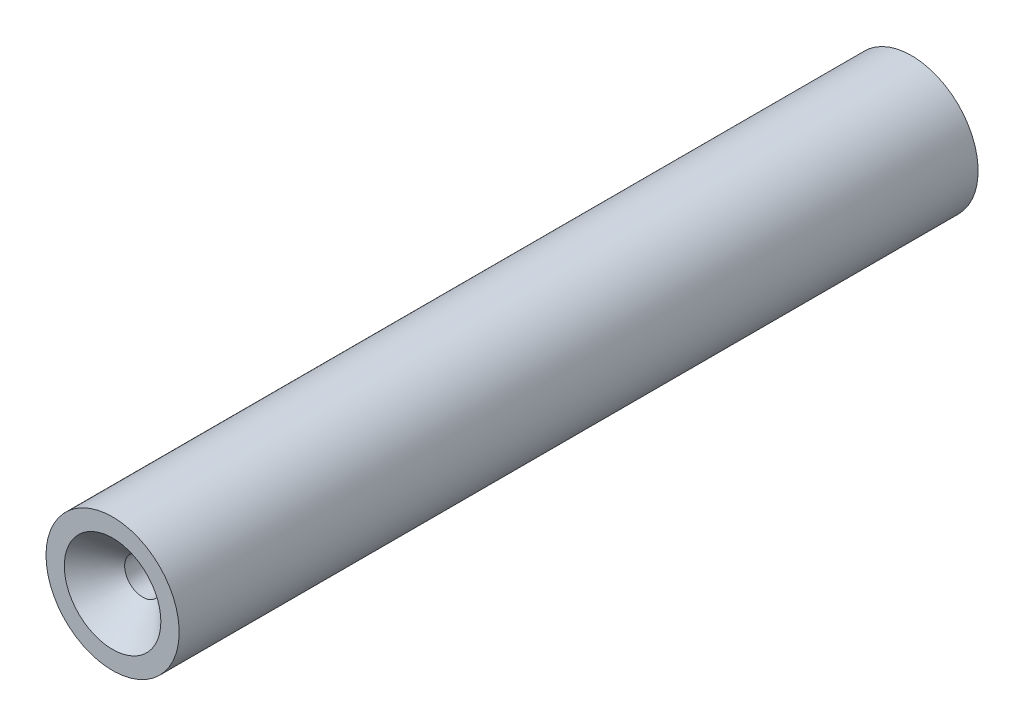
ISO-10303-21;
HEADER;
FILE_DESCRIPTION(('STEP AP214'),'2;1');
FILE_NAME('part.step','',(''),(''),'','','');
FILE_SCHEMA(('AUTOMOTIVE_DESIGN { 1 0 10303 214 1 1 1 1 }'));
ENDSEC;
DATA;
#1=APPLICATION_CONTEXT('core data for automotive mechanical design processes');
#2=APPLICATION_PROTOCOL_DEFINITION('international standard','automotive_design',2000,#1);
#3=PRODUCT_CONTEXT('',#1,'mechanical');
#4=PRODUCT('Part','Part','',(#3));
#5=PRODUCT_RELATED_PRODUCT_CATEGORY('part','',(#4));
#6=PRODUCT_DEFINITION_FORMATION('','',#4);
#7=PRODUCT_DEFINITION_CONTEXT('part definition',#1,'design');
#8=PRODUCT_DEFINITION('design','',#6,#7);
#9=PRODUCT_DEFINITION_SHAPE('','',#8);
#10=(LENGTH_UNIT() NAMED_UNIT(*) SI_UNIT(.MILLI.,.METRE.));
#11=(NAMED_UNIT(*) PLANE_ANGLE_UNIT() SI_UNIT($,.RADIAN.));
#12=(NAMED_UNIT(*) SI_UNIT($,.STERADIAN.) SOLID_ANGLE_UNIT());
#13=UNCERTAINTY_MEASURE_WITH_UNIT(LENGTH_MEASURE(1.E-05),#10,'distance_accuracy_value','');
#14=(GEOMETRIC_REPRESENTATION_CONTEXT(3) GLOBAL_UNCERTAINTY_ASSIGNED_CONTEXT((#13)) GLOBAL_UNIT_ASSIGNED_CONTEXT((#10,
#11,#12)) REPRESENTATION_CONTEXT('',''));
#15=CARTESIAN_POINT('',(0.,0.,0.));
#16=DIRECTION('',(0.,0.,1.));
#17=DIRECTION('',(1.,0.,0.));
#18=AXIS2_PLACEMENT_3D('',#15,#16,#17);
#19=CARTESIAN_POINT('',(-114.66320988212,59.9894740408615,76.2));
#20=DIRECTION('',(0.,0.,-1.));
#21=DIRECTION('',(-1.,0.,0.));
#22=AXIS2_PLACEMENT_3D('',#19,#20,#21);
#23=CYLINDRICAL_SURFACE('',#22,6.35);
#24=CARTESIAN_POINT('',(-114.66320988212,59.9894740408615,76.2));
#25=DIRECTION('',(0.,0.,1.));
#26=DIRECTION('',(1.,0.,0.));
#27=AXIS2_PLACEMENT_3D('',#24,#25,#26);
#28=CIRCLE('',#27,6.35);
#29=CARTESIAN_POINT('',(-121.01320988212,59.9894740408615,76.2));
#30=VERTEX_POINT('',#29);
#31=EDGE_CURVE('E11',#30,#30,#28,.T.);
#32=CARTESIAN_POINT('',(-114.66320988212,59.9894740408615,0.));
#33=DIRECTION('',(0.,0.,1.));
#34=DIRECTION('',(1.,0.,0.));
#35=AXIS2_PLACEMENT_3D('',#32,#33,#34);
#36=CIRCLE('',#35,6.35);
#37=CARTESIAN_POINT('',(-121.01320988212,59.9894740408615,0.));
#38=VERTEX_POINT('',#37);
#39=EDGE_CURVE('E43',#38,#38,#36,.T.);
#40=CARTESIAN_POINT('',(-121.01320988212,59.9894740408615,76.2));
#41=CARTESIAN_POINT('',(-121.01320988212,59.9894740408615,75.40625));
#42=CARTESIAN_POINT('',(-121.01320988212,59.9894740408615,74.6125));
#43=CARTESIAN_POINT('',(-121.01320988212,59.9894740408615,73.025));
#44=CARTESIAN_POINT('',(-121.01320988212,59.9894740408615,72.23125));
#45=CARTESIAN_POINT('',(-121.01320988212,59.9894740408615,70.64375));
#46=CARTESIAN_POINT('',(-121.01320988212,59.9894740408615,69.85));
#47=CARTESIAN_POINT('',(-121.01320988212,59.9894740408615,68.2625));
#48=CARTESIAN_POINT('',(-121.01320988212,59.9894740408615,67.46875));
#49=CARTESIAN_POINT('',(-121.01320988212,59.9894740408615,65.88125));
#50=CARTESIAN_POINT('',(-121.01320988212,59.9894740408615,65.0875));
#51=CARTESIAN_POINT('',(-121.01320988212,59.9894740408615,63.5));
#52=CARTESIAN_POINT('',(-121.01320988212,59.9894740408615,62.70625));
#53=CARTESIAN_POINT('',(-121.01320988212,59.9894740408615,61.11875));
#54=CARTESIAN_POINT('',(-121.01320988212,59.9894740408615,60.325));
#55=CARTESIAN_POINT('',(-121.01320988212,59.9894740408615,58.7375));
#56=CARTESIAN_POINT('',(-121.01320988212,59.9894740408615,57.94375));
#57=CARTESIAN_POINT('',(-121.01320988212,59.9894740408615,56.35625));
#58=CARTESIAN_POINT('',(-121.01320988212,59.9894740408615,55.5625));
#59=CARTESIAN_POINT('',(-121.01320988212,59.9894740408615,53.975));
#60=CARTESIAN_POINT('',(-121.01320988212,59.9894740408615,53.18125));
#61=CARTESIAN_POINT('',(-121.01320988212,59.9894740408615,51.59375));
#62=CARTESIAN_POINT('',(-121.01320988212,59.9894740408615,50.8));
#63=CARTESIAN_POINT('',(-121.01320988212,59.9894740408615,49.2125));
#64=CARTESIAN_POINT('',(-121.01320988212,59.9894740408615,48.41875));
#65=CARTESIAN_POINT('',(-121.01320988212,59.9894740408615,46.83125));
#66=CARTESIAN_POINT('',(-121.01320988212,59.9894740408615,46.0375));
#67=CARTESIAN_POINT('',(-121.01320988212,59.9894740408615,44.45));
#68=CARTESIAN_POINT('',(-121.01320988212,59.9894740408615,43.65625));
#69=CARTESIAN_POINT('',(-121.01320988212,59.9894740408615,42.06875));
#70=CARTESIAN_POINT('',(-121.01320988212,59.9894740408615,41.275));
#71=CARTESIAN_POINT('',(-121.01320988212,59.9894740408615,39.6875));
#72=CARTESIAN_POINT('',(-121.01320988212,59.9894740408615,38.89375));
#73=CARTESIAN_POINT('',(-121.01320988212,59.9894740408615,37.30625));
#74=CARTESIAN_POINT('',(-121.01320988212,59.9894740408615,36.5125));
#75=CARTESIAN_POINT('',(-121.01320988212,59.9894740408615,34.925));
#76=CARTESIAN_POINT('',(-121.01320988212,59.9894740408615,34.13125));
#77=CARTESIAN_POINT('',(-121.01320988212,59.9894740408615,32.54375));
#78=CARTESIAN_POINT('',(-121.01320988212,59.9894740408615,31.75));
#79=CARTESIAN_POINT('',(-121.01320988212,59.9894740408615,30.1625));
#80=CARTESIAN_POINT('',(-121.01320988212,59.9894740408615,29.36875));
#81=CARTESIAN_POINT('',(-121.01320988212,59.9894740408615,27.78125));
#82=CARTESIAN_POINT('',(-121.01320988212,59.9894740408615,26.9875));
#83=CARTESIAN_POINT('',(-121.01320988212,59.9894740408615,25.4));
#84=CARTESIAN_POINT('',(-121.01320988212,59.9894740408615,24.60625));
#85=CARTESIAN_POINT('',(-121.01320988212,59.9894740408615,23.01875));
#86=CARTESIAN_POINT('',(-121.01320988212,59.9894740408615,22.225));
#87=CARTESIAN_POINT('',(-121.01320988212,59.9894740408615,20.6375));
#88=CARTESIAN_POINT('',(-121.01320988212,59.9894740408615,19.84375));
#89=CARTESIAN_POINT('',(-121.01320988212,59.9894740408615,18.25625));
#90=CARTESIAN_POINT('',(-121.01320988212,59.9894740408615,17.4625));
#91=CARTESIAN_POINT('',(-121.01320988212,59.9894740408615,15.875));
#92=CARTESIAN_POINT('',(-121.01320988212,59.9894740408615,15.08125));
#93=CARTESIAN_POINT('',(-121.01320988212,59.9894740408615,13.49375));
#94=CARTESIAN_POINT('',(-121.01320988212,59.9894740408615,12.7));
#95=CARTESIAN_POINT('',(-121.01320988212,59.9894740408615,11.1125));
#96=CARTESIAN_POINT('',(-121.01320988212,59.9894740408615,10.31875));
#97=CARTESIAN_POINT('',(-121.01320988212,59.9894740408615,8.73125));
#98=CARTESIAN_POINT('',(-121.01320988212,59.9894740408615,7.93750000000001));
#99=CARTESIAN_POINT('',(-121.01320988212,59.9894740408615,6.35));
#100=CARTESIAN_POINT('',(-121.01320988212,59.9894740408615,5.55625));
#101=CARTESIAN_POINT('',(-121.01320988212,59.9894740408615,3.96875));
#102=CARTESIAN_POINT('',(-121.01320988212,59.9894740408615,3.175));
#103=CARTESIAN_POINT('',(-121.01320988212,59.9894740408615,1.5875));
#104=CARTESIAN_POINT('',(-121.01320988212,59.9894740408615,0.793750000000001));
#105=CARTESIAN_POINT('',(-121.01320988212,59.9894740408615,0.));
#106=B_SPLINE_CURVE_WITH_KNOTS('',3,(#40,#41,#42,#43,#44,#45,#46,#47,#48,#49,#50,#51,#52,#53,
#54,#55,#56,#57,#58,#59,#60,#61,#62,#63,#64,#65,#66,#67,#68,#69,#70,#71,#72,#73,#74,#75,#76,#77,
#78,#79,#80,#81,#82,#83,#84,#85,#86,#87,#88,#89,#90,#91,#92,#93,#94,#95,#96,#97,#98,#99,#100,
#101,#102,#103,#104,#105),.UNSPECIFIED.,.F.,.F.,(4,2,2,2,2,2,2,2,2,2,2,2,2,2,2,2,2,2,2,2,2,2,2,
2,2,2,2,2,2,2,2,2,4),(0.,2.38124999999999,4.76249999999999,7.14374999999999,9.52499999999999,
11.90625,14.2875,16.66875,19.05,21.43125,23.8125,26.19375,28.575,30.95625,33.3375,35.71875,38.1,
40.48125,42.8625,45.24375,47.625,50.00625,52.3875,54.76875,57.15,59.53125,61.9125,64.29375,
66.675,69.05625,71.4375,73.81875,76.2),.UNSPECIFIED.);
#107=EDGE_CURVE('BSEAM40',#30,#38,#106,.T.);
#108=ORIENTED_EDGE('',*,*,#31,.F.);
#109=ORIENTED_EDGE('',*,*,#39,.T.);
#110=ORIENTED_EDGE('',*,*,#107,.T.);
#111=ORIENTED_EDGE('',*,*,#107,.F.);
#112=EDGE_LOOP('',(#108,#110,#109,#111));
#113=FACE_BOUND('',#112,.T.);
#114=ADVANCED_FACE('F40',(#113),#23,.T.);
#115=CARTESIAN_POINT('',(-114.66320988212,59.9894740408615,76.2));
#116=DIRECTION('',(0.,0.,1.));
#117=DIRECTION('',(1.,0.,0.));
#118=AXIS2_PLACEMENT_3D('',#115,#116,#117);
#119=PLANE('',#118);
#120=CARTESIAN_POINT('',(-114.66320988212,59.9894740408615,76.2));
#121=DIRECTION('',(0.,0.,1.));
#122=DIRECTION('',(1.,0.,0.));
#123=AXIS2_PLACEMENT_3D('',#120,#121,#122);
#124=CIRCLE('',#123,4.60375);
#125=CARTESIAN_POINT('',(-110.059459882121,59.9894740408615,76.2));
#126=VERTEX_POINT('',#125);
#127=EDGE_CURVE('E63',#126,#126,#124,.T.);
#128=ORIENTED_EDGE('',*,*,#127,.F.);
#129=EDGE_LOOP('',(#128));
#130=FACE_BOUND('',#129,.T.);
#131=ORIENTED_EDGE('',*,*,#31,.T.);
#132=EDGE_LOOP('',(#131));
#133=FACE_BOUND('',#132,.T.);
#134=ADVANCED_FACE('F71',(#130,#133),#119,.T.);
#135=CARTESIAN_POINT('',(-114.66320988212,59.9894740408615,0.));
#136=DIRECTION('',(0.,0.,1.));
#137=DIRECTION('',(1.,0.,0.));
#138=AXIS2_PLACEMENT_3D('',#135,#136,#137);
#139=PLANE('',#138);
#140=ORIENTED_EDGE('',*,*,#39,.F.);
#141=EDGE_LOOP('',(#140));
#142=FACE_BOUND('',#141,.T.);
#143=ADVANCED_FACE('F53',(#142),#139,.F.);
#144=CARTESIAN_POINT('',(-114.66320988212,59.9894740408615,63.5));
#145=DIRECTION('',(0.,0.,1.));
#146=DIRECTION('',(1.,0.,0.));
#147=AXIS2_PLACEMENT_3D('',#144,#145,#146);
#148=CONICAL_SURFACE('',#147,1.7272,1.02974425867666);
#149=CARTESIAN_POINT('',(-114.66320988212,59.9894740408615,62.4621935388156));
#150=VERTEX_POINT('',#149);
#151=VERTEX_LOOP('',#150);
#152=FACE_BOUND('',#151,.T.);
#153=CARTESIAN_POINT('',(-114.66320988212,59.9894740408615,63.5));
#154=DIRECTION('',(0.,0.,1.));
#155=DIRECTION('',(1.,0.,0.));
#156=AXIS2_PLACEMENT_3D('',#153,#154,#155);
#157=CIRCLE('',#156,1.7272);
#158=CARTESIAN_POINT('',(-112.936009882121,59.9894740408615,63.5));
#159=VERTEX_POINT('',#158);
#160=EDGE_CURVE('E57',#159,#159,#157,.T.);
#161=ORIENTED_EDGE('',*,*,#160,.T.);
#162=EDGE_LOOP('',(#161));
#163=FACE_BOUND('',#162,.T.);
#164=ADVANCED_FACE('F49',(#152,#163),#148,.F.);
#165=CARTESIAN_POINT('',(-114.66320988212,59.9894740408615,76.2));
#166=DIRECTION('',(0.,0.,1.));
#167=DIRECTION('',(1.,0.,0.));
#168=AXIS2_PLACEMENT_3D('',#165,#166,#167);
#169=CYLINDRICAL_SURFACE('',#168,1.7272);
#170=ORIENTED_EDGE('',*,*,#160,.F.);
#171=EDGE_LOOP('',(#170));
#172=FACE_BOUND('',#171,.T.);
#173=CARTESIAN_POINT('',(-114.66320988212,59.9894740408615,73.32345));
#174=DIRECTION('',(0.,0.,1.));
#175=DIRECTION('',(1.,0.,0.));
#176=AXIS2_PLACEMENT_3D('',#173,#174,#175);
#177=CIRCLE('',#176,1.7272);
#178=CARTESIAN_POINT('',(-112.936009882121,59.9894740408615,73.32345));
#179=VERTEX_POINT('',#178);
#180=EDGE_CURVE('E59',#179,#179,#177,.T.);
#181=ORIENTED_EDGE('',*,*,#180,.T.);
#182=EDGE_LOOP('',(#181));
#183=FACE_BOUND('',#182,.T.);
#184=ADVANCED_FACE('F52',(#172,#183),#169,.F.);
#185=CARTESIAN_POINT('',(-114.66320988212,59.9894740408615,76.2));
#186=DIRECTION('',(0.,0.,1.));
#187=DIRECTION('',(1.,0.,0.));
#188=AXIS2_PLACEMENT_3D('',#185,#186,#187);
#189=CONICAL_SURFACE('',#188,4.60375,0.785398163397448);
#190=ORIENTED_EDGE('',*,*,#180,.F.);
#191=EDGE_LOOP('',(#190));
#192=FACE_BOUND('',#191,.T.);
#193=ORIENTED_EDGE('',*,*,#127,.T.);
#194=EDGE_LOOP('',(#193));
#195=FACE_BOUND('',#194,.T.);
#196=ADVANCED_FACE('F69',(#192,#195),#189,.F.);
#197=CLOSED_SHELL('',(#114,#134,#143,#164,#184,#196));
#198=MANIFOLD_SOLID_BREP('B2',#197);
#199=ADVANCED_BREP_SHAPE_REPRESENTATION('',(#18,#198),#14);
#200=SHAPE_DEFINITION_REPRESENTATION(#9,#199);
ENDSEC;
END-ISO-10303-21;
